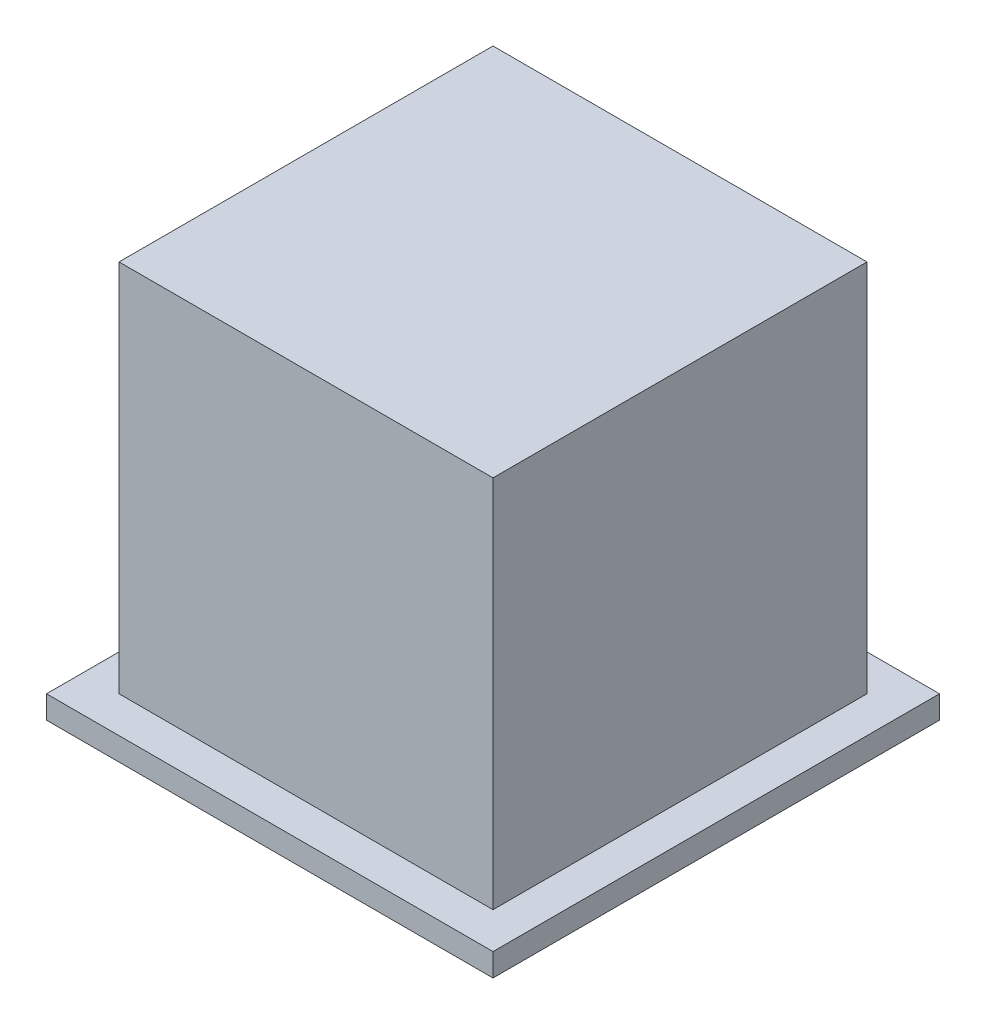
ISO-10303-21;
HEADER;
FILE_DESCRIPTION(('STEP AP214'),'2;1');
FILE_NAME('part.step','',(''),(''),'','','');
FILE_SCHEMA(('AUTOMOTIVE_DESIGN { 1 0 10303 214 1 1 1 1 }'));
ENDSEC;
DATA;
#1=APPLICATION_CONTEXT('core data for automotive mechanical design processes');
#2=APPLICATION_PROTOCOL_DEFINITION('international standard','automotive_design',2000,#1);
#3=PRODUCT_CONTEXT('',#1,'mechanical');
#4=PRODUCT('Part','Part','',(#3));
#5=PRODUCT_RELATED_PRODUCT_CATEGORY('part','',(#4));
#6=PRODUCT_DEFINITION_FORMATION('','',#4);
#7=PRODUCT_DEFINITION_CONTEXT('part definition',#1,'design');
#8=PRODUCT_DEFINITION('design','',#6,#7);
#9=PRODUCT_DEFINITION_SHAPE('','',#8);
#10=(LENGTH_UNIT() NAMED_UNIT(*) SI_UNIT(.MILLI.,.METRE.));
#11=(NAMED_UNIT(*) PLANE_ANGLE_UNIT() SI_UNIT($,.RADIAN.));
#12=(NAMED_UNIT(*) SI_UNIT($,.STERADIAN.) SOLID_ANGLE_UNIT());
#13=UNCERTAINTY_MEASURE_WITH_UNIT(LENGTH_MEASURE(1.E-05),#10,'distance_accuracy_value','');
#14=(GEOMETRIC_REPRESENTATION_CONTEXT(3) GLOBAL_UNCERTAINTY_ASSIGNED_CONTEXT((#13)) GLOBAL_UNIT_ASSIGNED_CONTEXT((#10,
#11,#12)) REPRESENTATION_CONTEXT('',''));
#15=CARTESIAN_POINT('',(0.,0.,0.));
#16=DIRECTION('',(0.,0.,1.));
#17=DIRECTION('',(1.,0.,0.));
#18=AXIS2_PLACEMENT_3D('',#15,#16,#17);
#19=CARTESIAN_POINT('',(-21.5,49.,-21.5));
#20=DIRECTION('',(0.,0.,1.));
#21=DIRECTION('',(1.,0.,0.));
#22=AXIS2_PLACEMENT_3D('',#19,#20,#21);
#23=PLANE('',#22);
#24=DIRECTION('',(-1.,0.,0.));
#25=VECTOR('',#24,1.);
#26=CARTESIAN_POINT('',(-21.5,0.,-21.5));
#27=LINE('',#26,#25);
#28=CARTESIAN_POINT('',(-5.5,0.,-21.5));
#29=VERTEX_POINT('',#28);
#30=CARTESIAN_POINT('',(-21.5,0.,-21.5));
#31=VERTEX_POINT('',#30);
#32=EDGE_CURVE('E174',#29,#31,#27,.T.);
#33=ORIENTED_EDGE('',*,*,#32,.F.);
#34=DIRECTION('',(0.,-1.,0.));
#35=VECTOR('',#34,1.);
#36=CARTESIAN_POINT('',(-5.5,49.,-21.5));
#37=LINE('',#36,#35);
#38=CARTESIAN_POINT('',(-5.5,49.,-21.5));
#39=VERTEX_POINT('',#38);
#40=EDGE_CURVE('E157',#39,#29,#37,.T.);
#41=ORIENTED_EDGE('',*,*,#40,.F.);
#42=DIRECTION('',(-1.,0.,0.));
#43=VECTOR('',#42,1.);
#44=CARTESIAN_POINT('',(-21.5,49.,-21.5));
#45=LINE('',#44,#43);
#46=CARTESIAN_POINT('',(-21.5,49.,-21.5));
#47=VERTEX_POINT('',#46);
#48=EDGE_CURVE('E277',#39,#47,#45,.T.);
#49=ORIENTED_EDGE('',*,*,#48,.T.);
#50=DIRECTION('',(0.,-1.,0.));
#51=VECTOR('',#50,1.);
#52=CARTESIAN_POINT('',(-21.5,49.,-21.5));
#53=LINE('',#52,#51);
#54=EDGE_CURVE('E182',#47,#31,#53,.T.);
#55=ORIENTED_EDGE('',*,*,#54,.T.);
#56=EDGE_LOOP('',(#33,#41,#49,#55));
#57=FACE_BOUND('',#56,.T.);
#58=ADVANCED_FACE('F33',(#57),#23,.T.);
#59=CARTESIAN_POINT('',(-29.25,3.,-29.25));
#60=DIRECTION('',(0.,0.,-1.));
#61=DIRECTION('',(-1.,0.,0.));
#62=AXIS2_PLACEMENT_3D('',#59,#60,#61);
#63=PLANE('',#62);
#64=DIRECTION('',(0.,1.,0.));
#65=VECTOR('',#64,1.);
#66=CARTESIAN_POINT('',(-5.5,3.,-29.25));
#67=LINE('',#66,#65);
#68=CARTESIAN_POINT('',(-5.5,0.,-29.25));
#69=VERTEX_POINT('',#68);
#70=CARTESIAN_POINT('',(-5.5,3.,-29.25));
#71=VERTEX_POINT('',#70);
#72=EDGE_CURVE('E361',#69,#71,#67,.T.);
#73=ORIENTED_EDGE('',*,*,#72,.F.);
#74=DIRECTION('',(1.,0.,0.));
#75=VECTOR('',#74,1.);
#76=CARTESIAN_POINT('',(-29.25,0.,-29.25));
#77=LINE('',#76,#75);
#78=CARTESIAN_POINT('',(-29.25,0.,-29.25));
#79=VERTEX_POINT('',#78);
#80=EDGE_CURVE('E178',#79,#69,#77,.T.);
#81=ORIENTED_EDGE('',*,*,#80,.F.);
#82=DIRECTION('',(0.,-1.,0.));
#83=VECTOR('',#82,1.);
#84=CARTESIAN_POINT('',(-29.25,3.,-29.25));
#85=LINE('',#84,#83);
#86=CARTESIAN_POINT('',(-29.25,3.,-29.25));
#87=VERTEX_POINT('',#86);
#88=EDGE_CURVE('E250',#87,#79,#85,.T.);
#89=ORIENTED_EDGE('',*,*,#88,.F.);
#90=DIRECTION('',(1.,0.,0.));
#91=VECTOR('',#90,1.);
#92=CARTESIAN_POINT('',(-29.25,3.,-29.25));
#93=LINE('',#92,#91);
#94=EDGE_CURVE('E241',#87,#71,#93,.T.);
#95=ORIENTED_EDGE('',*,*,#94,.T.);
#96=EDGE_LOOP('',(#73,#81,#89,#95));
#97=FACE_BOUND('',#96,.T.);
#98=ADVANCED_FACE('F330',(#97),#63,.T.);
#99=CARTESIAN_POINT('',(0.,0.,0.));
#100=DIRECTION('',(0.,1.,0.));
#101=DIRECTION('',(0.,0.,1.));
#102=AXIS2_PLACEMENT_3D('',#99,#100,#101);
#103=PLANE('',#102);
#104=ORIENTED_EDGE('',*,*,#80,.T.);
#105=DIRECTION('',(0.,0.,1.));
#106=VECTOR('',#105,1.);
#107=CARTESIAN_POINT('',(-5.5,0.,-32.21));
#108=LINE('',#107,#106);
#109=EDGE_CURVE('E160',#69,#29,#108,.T.);
#110=ORIENTED_EDGE('',*,*,#109,.T.);
#111=ORIENTED_EDGE('',*,*,#32,.T.);
#112=DIRECTION('',(0.,0.,1.));
#113=VECTOR('',#112,1.);
#114=CARTESIAN_POINT('',(-21.5,0.,-21.5));
#115=LINE('',#114,#113);
#116=CARTESIAN_POINT('',(-21.5,0.,21.5));
#117=VERTEX_POINT('',#116);
#118=EDGE_CURVE('E188',#31,#117,#115,.T.);
#119=ORIENTED_EDGE('',*,*,#118,.T.);
#120=DIRECTION('',(1.,0.,0.));
#121=VECTOR('',#120,1.);
#122=CARTESIAN_POINT('',(-21.5,0.,21.5));
#123=LINE('',#122,#121);
#124=CARTESIAN_POINT('',(21.5,0.,21.5));
#125=VERTEX_POINT('',#124);
#126=EDGE_CURVE('E195',#117,#125,#123,.T.);
#127=ORIENTED_EDGE('',*,*,#126,.T.);
#128=DIRECTION('',(0.,0.,-1.));
#129=VECTOR('',#128,1.);
#130=CARTESIAN_POINT('',(21.5,0.,-21.5));
#131=LINE('',#130,#129);
#132=CARTESIAN_POINT('',(21.5,0.,-21.5));
#133=VERTEX_POINT('',#132);
#134=EDGE_CURVE('E185',#125,#133,#131,.T.);
#135=ORIENTED_EDGE('',*,*,#134,.T.);
#136=CARTESIAN_POINT('',(5.5,0.,-21.5));
#137=VERTEX_POINT('',#136);
#138=EDGE_CURVE('E184',#133,#137,#27,.T.);
#139=ORIENTED_EDGE('',*,*,#138,.T.);
#140=DIRECTION('',(0.,0.,1.));
#141=VECTOR('',#140,1.);
#142=CARTESIAN_POINT('',(5.5,0.,-32.21));
#143=LINE('',#142,#141);
#144=CARTESIAN_POINT('',(5.5,0.,-29.25));
#145=VERTEX_POINT('',#144);
#146=EDGE_CURVE('E179',#145,#137,#143,.T.);
#147=ORIENTED_EDGE('',*,*,#146,.F.);
#148=CARTESIAN_POINT('',(29.25,0.,-29.25));
#149=VERTEX_POINT('',#148);
#150=EDGE_CURVE('E252',#145,#149,#77,.T.);
#151=ORIENTED_EDGE('',*,*,#150,.T.);
#152=DIRECTION('',(0.,0.,1.));
#153=VECTOR('',#152,1.);
#154=CARTESIAN_POINT('',(29.25,0.,29.25));
#155=LINE('',#154,#153);
#156=CARTESIAN_POINT('',(29.25,0.,29.25));
#157=VERTEX_POINT('',#156);
#158=EDGE_CURVE('E254',#149,#157,#155,.T.);
#159=ORIENTED_EDGE('',*,*,#158,.T.);
#160=DIRECTION('',(-1.,0.,0.));
#161=VECTOR('',#160,1.);
#162=CARTESIAN_POINT('',(-29.25,0.,29.25));
#163=LINE('',#162,#161);
#164=CARTESIAN_POINT('',(-29.25,0.,29.25));
#165=VERTEX_POINT('',#164);
#166=EDGE_CURVE('E240',#157,#165,#163,.T.);
#167=ORIENTED_EDGE('',*,*,#166,.T.);
#168=DIRECTION('',(0.,0.,-1.));
#169=VECTOR('',#168,1.);
#170=CARTESIAN_POINT('',(-29.25,0.,29.25));
#171=LINE('',#170,#169);
#172=EDGE_CURVE('E231',#165,#79,#171,.T.);
#173=ORIENTED_EDGE('',*,*,#172,.T.);
#174=EDGE_LOOP('',(#104,#110,#111,#119,#127,#135,#139,#147,#151,#159,#167,#173));
#175=FACE_BOUND('',#174,.T.);
#176=ADVANCED_FACE('F172',(#175),#103,.F.);
#177=CARTESIAN_POINT('',(21.5,49.,-21.5));
#178=DIRECTION('',(-1.,0.,0.));
#179=DIRECTION('',(0.,0.,1.));
#180=AXIS2_PLACEMENT_3D('',#177,#178,#179);
#181=PLANE('',#180);
#182=ORIENTED_EDGE('',*,*,#134,.F.);
#183=DIRECTION('',(0.,-1.,0.));
#184=VECTOR('',#183,1.);
#185=CARTESIAN_POINT('',(21.5,49.,21.5));
#186=LINE('',#185,#184);
#187=CARTESIAN_POINT('',(21.5,49.,21.5));
#188=VERTEX_POINT('',#187);
#189=EDGE_CURVE('E199',#188,#125,#186,.T.);
#190=ORIENTED_EDGE('',*,*,#189,.F.);
#191=DIRECTION('',(0.,0.,-1.));
#192=VECTOR('',#191,1.);
#193=CARTESIAN_POINT('',(21.5,49.,-21.5));
#194=LINE('',#193,#192);
#195=CARTESIAN_POINT('',(21.5,49.,-21.5));
#196=VERTEX_POINT('',#195);
#197=EDGE_CURVE('E198',#188,#196,#194,.T.);
#198=ORIENTED_EDGE('',*,*,#197,.T.);
#199=DIRECTION('',(0.,-1.,0.));
#200=VECTOR('',#199,1.);
#201=CARTESIAN_POINT('',(21.5,49.,-21.5));
#202=LINE('',#201,#200);
#203=EDGE_CURVE('E206',#196,#133,#202,.T.);
#204=ORIENTED_EDGE('',*,*,#203,.T.);
#205=EDGE_LOOP('',(#182,#190,#198,#204));
#206=FACE_BOUND('',#205,.T.);
#207=ADVANCED_FACE('F292',(#206),#181,.T.);
#208=DIRECTION('',(0.,1.,0.));
#209=VECTOR('',#208,1.);
#210=CARTESIAN_POINT('',(5.5,49.,-21.5));
#211=LINE('',#210,#209);
#212=CARTESIAN_POINT('',(5.5,49.,-21.5));
#213=VERTEX_POINT('',#212);
#214=EDGE_CURVE('E167',#137,#213,#211,.T.);
#215=ORIENTED_EDGE('',*,*,#214,.F.);
#216=ORIENTED_EDGE('',*,*,#138,.F.);
#217=ORIENTED_EDGE('',*,*,#203,.F.);
#218=EDGE_CURVE('E278',#196,#213,#45,.T.);
#219=ORIENTED_EDGE('',*,*,#218,.T.);
#220=EDGE_LOOP('',(#215,#216,#217,#219));
#221=FACE_BOUND('',#220,.T.);
#222=ADVANCED_FACE('F332',(#221),#23,.T.);
#223=CARTESIAN_POINT('',(-21.5,49.,-21.5));
#224=DIRECTION('',(1.,0.,0.));
#225=DIRECTION('',(0.,0.,-1.));
#226=AXIS2_PLACEMENT_3D('',#223,#224,#225);
#227=PLANE('',#226);
#228=ORIENTED_EDGE('',*,*,#118,.F.);
#229=ORIENTED_EDGE('',*,*,#54,.F.);
#230=DIRECTION('',(0.,0.,1.));
#231=VECTOR('',#230,1.);
#232=CARTESIAN_POINT('',(-21.5,49.,-21.5));
#233=LINE('',#232,#231);
#234=CARTESIAN_POINT('',(-21.5,49.,21.5));
#235=VERTEX_POINT('',#234);
#236=EDGE_CURVE('E281',#47,#235,#233,.T.);
#237=ORIENTED_EDGE('',*,*,#236,.T.);
#238=DIRECTION('',(0.,-1.,0.));
#239=VECTOR('',#238,1.);
#240=CARTESIAN_POINT('',(-21.5,49.,21.5));
#241=LINE('',#240,#239);
#242=EDGE_CURVE('E202',#235,#117,#241,.T.);
#243=ORIENTED_EDGE('',*,*,#242,.T.);
#244=EDGE_LOOP('',(#228,#229,#237,#243));
#245=FACE_BOUND('',#244,.T.);
#246=ADVANCED_FACE('F296',(#245),#227,.T.);
#247=CARTESIAN_POINT('',(-21.5,49.,21.5));
#248=DIRECTION('',(0.,0.,-1.));
#249=DIRECTION('',(-1.,0.,0.));
#250=AXIS2_PLACEMENT_3D('',#247,#248,#249);
#251=PLANE('',#250);
#252=ORIENTED_EDGE('',*,*,#126,.F.);
#253=ORIENTED_EDGE('',*,*,#242,.F.);
#254=DIRECTION('',(1.,0.,0.));
#255=VECTOR('',#254,1.);
#256=CARTESIAN_POINT('',(-21.5,49.,21.5));
#257=LINE('',#256,#255);
#258=EDGE_CURVE('E203',#235,#188,#257,.T.);
#259=ORIENTED_EDGE('',*,*,#258,.T.);
#260=ORIENTED_EDGE('',*,*,#189,.T.);
#261=EDGE_LOOP('',(#252,#253,#259,#260));
#262=FACE_BOUND('',#261,.T.);
#263=ADVANCED_FACE('F288',(#262),#251,.T.);
#264=CARTESIAN_POINT('',(0.,49.,0.));
#265=DIRECTION('',(0.,1.,0.));
#266=DIRECTION('',(0.,0.,1.));
#267=AXIS2_PLACEMENT_3D('',#264,#265,#266);
#268=PLANE('',#267);
#269=ORIENTED_EDGE('',*,*,#48,.F.);
#270=DIRECTION('',(0.,0.,-1.));
#271=VECTOR('',#270,1.);
#272=CARTESIAN_POINT('',(-5.5,49.,-17.92));
#273=LINE('',#272,#271);
#274=CARTESIAN_POINT('',(-5.5,49.,-24.5));
#275=VERTEX_POINT('',#274);
#276=EDGE_CURVE('E163',#39,#275,#273,.T.);
#277=ORIENTED_EDGE('',*,*,#276,.T.);
#278=DIRECTION('',(1.,0.,0.));
#279=VECTOR('',#278,1.);
#280=CARTESIAN_POINT('',(5.5,49.,-24.5));
#281=LINE('',#280,#279);
#282=CARTESIAN_POINT('',(5.5,49.,-24.5));
#283=VERTEX_POINT('',#282);
#284=EDGE_CURVE('E301',#275,#283,#281,.T.);
#285=ORIENTED_EDGE('',*,*,#284,.T.);
#286=DIRECTION('',(0.,0.,-1.));
#287=VECTOR('',#286,1.);
#288=CARTESIAN_POINT('',(5.5,49.,-17.92));
#289=LINE('',#288,#287);
#290=EDGE_CURVE('E168',#213,#283,#289,.T.);
#291=ORIENTED_EDGE('',*,*,#290,.F.);
#292=ORIENTED_EDGE('',*,*,#218,.F.);
#293=ORIENTED_EDGE('',*,*,#197,.F.);
#294=ORIENTED_EDGE('',*,*,#258,.F.);
#295=ORIENTED_EDGE('',*,*,#236,.F.);
#296=EDGE_LOOP('',(#269,#277,#285,#291,#292,#293,#294,#295));
#297=FACE_BOUND('',#296,.T.);
#298=ADVANCED_FACE('F297',(#297),#268,.F.);
#299=CARTESIAN_POINT('',(-29.25,3.,29.25));
#300=DIRECTION('',(-1.,0.,0.));
#301=DIRECTION('',(0.,0.,1.));
#302=AXIS2_PLACEMENT_3D('',#299,#300,#301);
#303=PLANE('',#302);
#304=ORIENTED_EDGE('',*,*,#172,.F.);
#305=DIRECTION('',(0.,-1.,0.));
#306=VECTOR('',#305,1.);
#307=CARTESIAN_POINT('',(-29.25,3.,29.25));
#308=LINE('',#307,#306);
#309=CARTESIAN_POINT('',(-29.25,3.,29.25));
#310=VERTEX_POINT('',#309);
#311=EDGE_CURVE('E259',#310,#165,#308,.T.);
#312=ORIENTED_EDGE('',*,*,#311,.F.);
#313=DIRECTION('',(0.,0.,-1.));
#314=VECTOR('',#313,1.);
#315=CARTESIAN_POINT('',(-29.25,3.,29.25));
#316=LINE('',#315,#314);
#317=EDGE_CURVE('E236',#310,#87,#316,.T.);
#318=ORIENTED_EDGE('',*,*,#317,.T.);
#319=ORIENTED_EDGE('',*,*,#88,.T.);
#320=EDGE_LOOP('',(#304,#312,#318,#319));
#321=FACE_BOUND('',#320,.T.);
#322=ADVANCED_FACE('F376',(#321),#303,.T.);
#323=CARTESIAN_POINT('',(-29.25,3.,29.25));
#324=DIRECTION('',(0.,0.,1.));
#325=DIRECTION('',(1.,0.,0.));
#326=AXIS2_PLACEMENT_3D('',#323,#324,#325);
#327=PLANE('',#326);
#328=ORIENTED_EDGE('',*,*,#166,.F.);
#329=DIRECTION('',(0.,-1.,0.));
#330=VECTOR('',#329,1.);
#331=CARTESIAN_POINT('',(29.25,3.,29.25));
#332=LINE('',#331,#330);
#333=CARTESIAN_POINT('',(29.25,3.,29.25));
#334=VERTEX_POINT('',#333);
#335=EDGE_CURVE('E262',#334,#157,#332,.T.);
#336=ORIENTED_EDGE('',*,*,#335,.F.);
#337=DIRECTION('',(-1.,0.,0.));
#338=VECTOR('',#337,1.);
#339=CARTESIAN_POINT('',(-29.25,3.,29.25));
#340=LINE('',#339,#338);
#341=EDGE_CURVE('E247',#334,#310,#340,.T.);
#342=ORIENTED_EDGE('',*,*,#341,.T.);
#343=ORIENTED_EDGE('',*,*,#311,.T.);
#344=EDGE_LOOP('',(#328,#336,#342,#343));
#345=FACE_BOUND('',#344,.T.);
#346=ADVANCED_FACE('F372',(#345),#327,.T.);
#347=CARTESIAN_POINT('',(29.25,3.,29.25));
#348=DIRECTION('',(1.,0.,0.));
#349=DIRECTION('',(0.,0.,-1.));
#350=AXIS2_PLACEMENT_3D('',#347,#348,#349);
#351=PLANE('',#350);
#352=ORIENTED_EDGE('',*,*,#158,.F.);
#353=DIRECTION('',(0.,-1.,0.));
#354=VECTOR('',#353,1.);
#355=CARTESIAN_POINT('',(29.25,3.,-29.25));
#356=LINE('',#355,#354);
#357=CARTESIAN_POINT('',(29.25,3.,-29.25));
#358=VERTEX_POINT('',#357);
#359=EDGE_CURVE('E264',#358,#149,#356,.T.);
#360=ORIENTED_EDGE('',*,*,#359,.F.);
#361=DIRECTION('',(0.,0.,1.));
#362=VECTOR('',#361,1.);
#363=CARTESIAN_POINT('',(29.25,3.,29.25));
#364=LINE('',#363,#362);
#365=EDGE_CURVE('E244',#358,#334,#364,.T.);
#366=ORIENTED_EDGE('',*,*,#365,.T.);
#367=ORIENTED_EDGE('',*,*,#335,.T.);
#368=EDGE_LOOP('',(#352,#360,#366,#367));
#369=FACE_BOUND('',#368,.T.);
#370=ADVANCED_FACE('F369',(#369),#351,.T.);
#371=DIRECTION('',(0.,-1.,0.));
#372=VECTOR('',#371,1.);
#373=CARTESIAN_POINT('',(5.49999999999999,3.,-29.25));
#374=LINE('',#373,#372);
#375=CARTESIAN_POINT('',(5.5,3.,-29.25));
#376=VERTEX_POINT('',#375);
#377=EDGE_CURVE('E353',#376,#145,#374,.T.);
#378=ORIENTED_EDGE('',*,*,#377,.F.);
#379=EDGE_CURVE('E239',#376,#358,#93,.T.);
#380=ORIENTED_EDGE('',*,*,#379,.T.);
#381=ORIENTED_EDGE('',*,*,#359,.T.);
#382=ORIENTED_EDGE('',*,*,#150,.F.);
#383=EDGE_LOOP('',(#378,#380,#381,#382));
#384=FACE_BOUND('',#383,.T.);
#385=ADVANCED_FACE('F339',(#384),#63,.T.);
#386=CARTESIAN_POINT('',(0.,3.,0.));
#387=DIRECTION('',(0.,-1.,0.));
#388=DIRECTION('',(0.,0.,-1.));
#389=AXIS2_PLACEMENT_3D('',#386,#387,#388);
#390=PLANE('',#389);
#391=DIRECTION('',(1.,0.,0.));
#392=VECTOR('',#391,1.);
#393=CARTESIAN_POINT('',(-24.5,3.,-24.5));
#394=LINE('',#393,#392);
#395=CARTESIAN_POINT('',(-24.5,3.,-24.5));
#396=VERTEX_POINT('',#395);
#397=CARTESIAN_POINT('',(-5.5,3.,-24.5));
#398=VERTEX_POINT('',#397);
#399=EDGE_CURVE('E229',#396,#398,#394,.T.);
#400=ORIENTED_EDGE('',*,*,#399,.T.);
#401=DIRECTION('',(0.,0.,-1.));
#402=VECTOR('',#401,1.);
#403=CARTESIAN_POINT('',(-5.5,3.,0.));
#404=LINE('',#403,#402);
#405=EDGE_CURVE('E307',#398,#71,#404,.T.);
#406=ORIENTED_EDGE('',*,*,#405,.T.);
#407=ORIENTED_EDGE('',*,*,#94,.F.);
#408=ORIENTED_EDGE('',*,*,#317,.F.);
#409=ORIENTED_EDGE('',*,*,#341,.F.);
#410=ORIENTED_EDGE('',*,*,#365,.F.);
#411=ORIENTED_EDGE('',*,*,#379,.F.);
#412=DIRECTION('',(0.,0.,1.));
#413=VECTOR('',#412,1.);
#414=CARTESIAN_POINT('',(5.5,3.,0.));
#415=LINE('',#414,#413);
#416=CARTESIAN_POINT('',(5.5,3.,-24.5));
#417=VERTEX_POINT('',#416);
#418=EDGE_CURVE('E355',#376,#417,#415,.T.);
#419=ORIENTED_EDGE('',*,*,#418,.T.);
#420=CARTESIAN_POINT('',(24.5,3.,-24.5));
#421=VERTEX_POINT('',#420);
#422=EDGE_CURVE('E228',#417,#421,#394,.T.);
#423=ORIENTED_EDGE('',*,*,#422,.T.);
#424=DIRECTION('',(0.,0.,1.));
#425=VECTOR('',#424,1.);
#426=CARTESIAN_POINT('',(24.5,3.,24.5));
#427=LINE('',#426,#425);
#428=CARTESIAN_POINT('',(24.5,3.,24.5));
#429=VERTEX_POINT('',#428);
#430=EDGE_CURVE('E218',#421,#429,#427,.T.);
#431=ORIENTED_EDGE('',*,*,#430,.T.);
#432=DIRECTION('',(-1.,0.,0.));
#433=VECTOR('',#432,1.);
#434=CARTESIAN_POINT('',(-24.5,3.,24.5));
#435=LINE('',#434,#433);
#436=CARTESIAN_POINT('',(-24.5,3.,24.5));
#437=VERTEX_POINT('',#436);
#438=EDGE_CURVE('E54',#429,#437,#435,.T.);
#439=ORIENTED_EDGE('',*,*,#438,.T.);
#440=DIRECTION('',(0.,0.,-1.));
#441=VECTOR('',#440,1.);
#442=CARTESIAN_POINT('',(-24.5,3.,24.5));
#443=LINE('',#442,#441);
#444=EDGE_CURVE('E48',#437,#396,#443,.T.);
#445=ORIENTED_EDGE('',*,*,#444,.T.);
#446=EDGE_LOOP('',(#400,#406,#407,#408,#409,#410,#411,#419,#423,#431,#439,#445));
#447=FACE_BOUND('',#446,.T.);
#448=ADVANCED_FACE('F225',(#447),#390,.F.);
#449=CARTESIAN_POINT('',(0.,52.,0.));
#450=DIRECTION('',(0.,1.,0.));
#451=DIRECTION('',(0.,0.,1.));
#452=AXIS2_PLACEMENT_3D('',#449,#450,#451);
#453=PLANE('',#452);
#454=DIRECTION('',(0.,0.,1.));
#455=VECTOR('',#454,1.);
#456=CARTESIAN_POINT('',(-24.5,52.,-24.5));
#457=LINE('',#456,#455);
#458=CARTESIAN_POINT('',(-24.5,52.,-24.5));
#459=VERTEX_POINT('',#458);
#460=CARTESIAN_POINT('',(-24.5,52.,24.5));
#461=VERTEX_POINT('',#460);
#462=EDGE_CURVE('E261',#459,#461,#457,.T.);
#463=ORIENTED_EDGE('',*,*,#462,.T.);
#464=DIRECTION('',(1.,0.,0.));
#465=VECTOR('',#464,1.);
#466=CARTESIAN_POINT('',(-24.5,52.,24.5));
#467=LINE('',#466,#465);
#468=CARTESIAN_POINT('',(24.5,52.,24.5));
#469=VERTEX_POINT('',#468);
#470=EDGE_CURVE('E270',#461,#469,#467,.T.);
#471=ORIENTED_EDGE('',*,*,#470,.T.);
#472=DIRECTION('',(0.,0.,-1.));
#473=VECTOR('',#472,1.);
#474=CARTESIAN_POINT('',(24.5,52.,-24.5));
#475=LINE('',#474,#473);
#476=CARTESIAN_POINT('',(24.5,52.,-24.5));
#477=VERTEX_POINT('',#476);
#478=EDGE_CURVE('E220',#469,#477,#475,.T.);
#479=ORIENTED_EDGE('',*,*,#478,.T.);
#480=DIRECTION('',(-1.,0.,0.));
#481=VECTOR('',#480,1.);
#482=CARTESIAN_POINT('',(-24.5,52.,-24.5));
#483=LINE('',#482,#481);
#484=EDGE_CURVE('E190',#477,#459,#483,.T.);
#485=ORIENTED_EDGE('',*,*,#484,.T.);
#486=EDGE_LOOP('',(#463,#471,#479,#485));
#487=FACE_BOUND('',#486,.T.);
#488=ADVANCED_FACE('F320',(#487),#453,.T.);
#489=CARTESIAN_POINT('',(-24.5,49.,-24.5));
#490=DIRECTION('',(0.,0.,1.));
#491=DIRECTION('',(1.,0.,0.));
#492=AXIS2_PLACEMENT_3D('',#489,#490,#491);
#493=PLANE('',#492);
#494=DIRECTION('',(0.,1.,0.));
#495=VECTOR('',#494,1.);
#496=CARTESIAN_POINT('',(-5.5,49.,-24.5));
#497=LINE('',#496,#495);
#498=EDGE_CURVE('E305',#398,#275,#497,.T.);
#499=ORIENTED_EDGE('',*,*,#498,.F.);
#500=ORIENTED_EDGE('',*,*,#399,.F.);
#501=DIRECTION('',(0.,-1.,0.));
#502=VECTOR('',#501,1.);
#503=CARTESIAN_POINT('',(-24.5,49.,-24.5));
#504=LINE('',#503,#502);
#505=EDGE_CURVE('E209',#459,#396,#504,.T.);
#506=ORIENTED_EDGE('',*,*,#505,.F.);
#507=ORIENTED_EDGE('',*,*,#484,.F.);
#508=DIRECTION('',(0.,-1.,0.));
#509=VECTOR('',#508,1.);
#510=CARTESIAN_POINT('',(24.5,49.,-24.5));
#511=LINE('',#510,#509);
#512=EDGE_CURVE('E211',#477,#421,#511,.T.);
#513=ORIENTED_EDGE('',*,*,#512,.T.);
#514=ORIENTED_EDGE('',*,*,#422,.F.);
#515=DIRECTION('',(0.,-1.,0.));
#516=VECTOR('',#515,1.);
#517=CARTESIAN_POINT('',(5.5,49.,-24.5));
#518=LINE('',#517,#516);
#519=EDGE_CURVE('E309',#283,#417,#518,.T.);
#520=ORIENTED_EDGE('',*,*,#519,.F.);
#521=ORIENTED_EDGE('',*,*,#284,.F.);
#522=EDGE_LOOP('',(#499,#500,#506,#507,#513,#514,#520,#521));
#523=FACE_BOUND('',#522,.T.);
#524=ADVANCED_FACE('F311',(#523),#493,.F.);
#525=CARTESIAN_POINT('',(24.5,49.,-24.5));
#526=DIRECTION('',(-1.,0.,0.));
#527=DIRECTION('',(0.,0.,1.));
#528=AXIS2_PLACEMENT_3D('',#525,#526,#527);
#529=PLANE('',#528);
#530=ORIENTED_EDGE('',*,*,#430,.F.);
#531=ORIENTED_EDGE('',*,*,#512,.F.);
#532=ORIENTED_EDGE('',*,*,#478,.F.);
#533=DIRECTION('',(0.,-1.,0.));
#534=VECTOR('',#533,1.);
#535=CARTESIAN_POINT('',(24.5,49.,24.5));
#536=LINE('',#535,#534);
#537=EDGE_CURVE('E41',#469,#429,#536,.T.);
#538=ORIENTED_EDGE('',*,*,#537,.T.);
#539=EDGE_LOOP('',(#530,#531,#532,#538));
#540=FACE_BOUND('',#539,.T.);
#541=ADVANCED_FACE('F217',(#540),#529,.F.);
#542=CARTESIAN_POINT('',(-24.5,49.,24.5));
#543=DIRECTION('',(0.,0.,-1.));
#544=DIRECTION('',(-1.,0.,0.));
#545=AXIS2_PLACEMENT_3D('',#542,#543,#544);
#546=PLANE('',#545);
#547=ORIENTED_EDGE('',*,*,#438,.F.);
#548=ORIENTED_EDGE('',*,*,#537,.F.);
#549=ORIENTED_EDGE('',*,*,#470,.F.);
#550=DIRECTION('',(0.,-1.,0.));
#551=VECTOR('',#550,1.);
#552=CARTESIAN_POINT('',(-24.5,49.,24.5));
#553=LINE('',#552,#551);
#554=EDGE_CURVE('E11',#461,#437,#553,.T.);
#555=ORIENTED_EDGE('',*,*,#554,.T.);
#556=EDGE_LOOP('',(#547,#548,#549,#555));
#557=FACE_BOUND('',#556,.T.);
#558=ADVANCED_FACE('F321',(#557),#546,.F.);
#559=CARTESIAN_POINT('',(-24.5,49.,-24.5));
#560=DIRECTION('',(1.,0.,0.));
#561=DIRECTION('',(0.,0.,-1.));
#562=AXIS2_PLACEMENT_3D('',#559,#560,#561);
#563=PLANE('',#562);
#564=ORIENTED_EDGE('',*,*,#444,.F.);
#565=ORIENTED_EDGE('',*,*,#554,.F.);
#566=ORIENTED_EDGE('',*,*,#462,.F.);
#567=ORIENTED_EDGE('',*,*,#505,.T.);
#568=EDGE_LOOP('',(#564,#565,#566,#567));
#569=FACE_BOUND('',#568,.T.);
#570=ADVANCED_FACE('F35',(#569),#563,.F.);
#571=CARTESIAN_POINT('',(5.5,49.,-17.92));
#572=DIRECTION('',(1.,0.,0.));
#573=DIRECTION('',(0.,1.,0.));
#574=AXIS2_PLACEMENT_3D('',#571,#572,#573);
#575=PLANE('',#574);
#576=ORIENTED_EDGE('',*,*,#214,.T.);
#577=ORIENTED_EDGE('',*,*,#290,.T.);
#578=ORIENTED_EDGE('',*,*,#519,.T.);
#579=ORIENTED_EDGE('',*,*,#418,.F.);
#580=ORIENTED_EDGE('',*,*,#377,.T.);
#581=ORIENTED_EDGE('',*,*,#146,.T.);
#582=EDGE_LOOP('',(#576,#577,#578,#579,#580,#581));
#583=FACE_BOUND('',#582,.T.);
#584=ADVANCED_FACE('F327',(#583),#575,.F.);
#585=CARTESIAN_POINT('',(-5.5,49.,-17.92));
#586=DIRECTION('',(-1.,0.,0.));
#587=DIRECTION('',(0.,-1.,0.));
#588=AXIS2_PLACEMENT_3D('',#585,#586,#587);
#589=PLANE('',#588);
#590=ORIENTED_EDGE('',*,*,#40,.T.);
#591=ORIENTED_EDGE('',*,*,#109,.F.);
#592=ORIENTED_EDGE('',*,*,#72,.T.);
#593=ORIENTED_EDGE('',*,*,#405,.F.);
#594=ORIENTED_EDGE('',*,*,#498,.T.);
#595=ORIENTED_EDGE('',*,*,#276,.F.);
#596=EDGE_LOOP('',(#590,#591,#592,#593,#594,#595));
#597=FACE_BOUND('',#596,.T.);
#598=ADVANCED_FACE('F159',(#597),#589,.F.);
#599=CLOSED_SHELL('',(#58,#98,#176,#207,#222,#246,#263,#298,#322,#346,#370,#385,#448,#488,#524,
#541,#558,#570,#584,#598));
#600=MANIFOLD_SOLID_BREP('B2',#599);
#601=ADVANCED_BREP_SHAPE_REPRESENTATION('',(#18,#600),#14);
#602=SHAPE_DEFINITION_REPRESENTATION(#9,#601);
ENDSEC;
END-ISO-10303-21;
